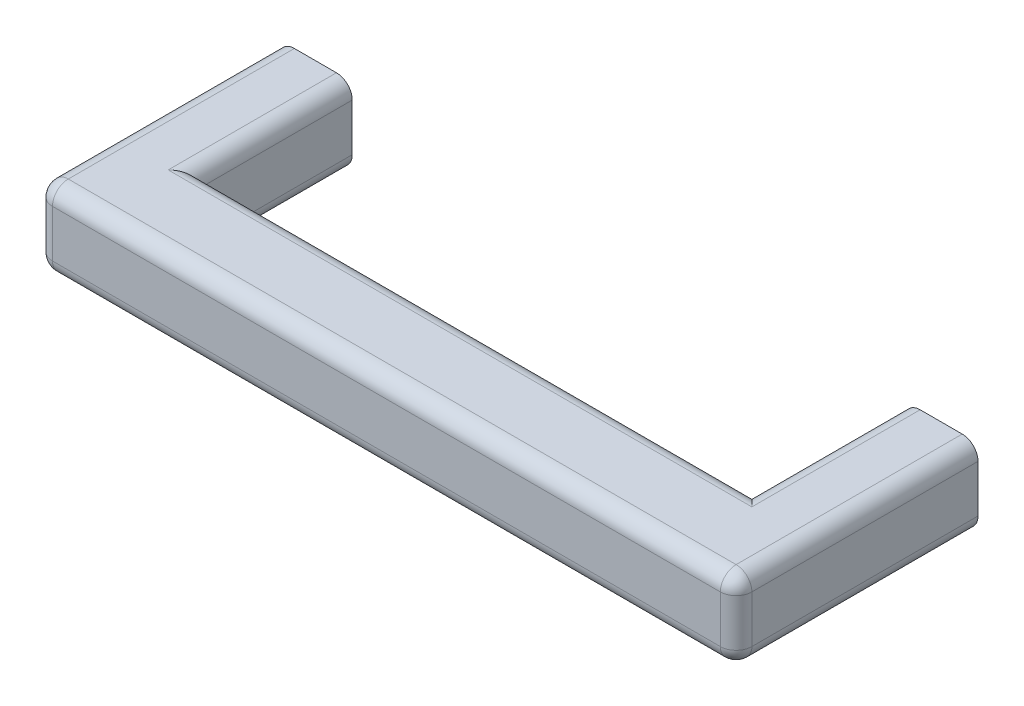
ISO-10303-21;
HEADER;
FILE_DESCRIPTION(('STEP AP214'),'2;1');
FILE_NAME('part.step','',(''),(''),'','','');
FILE_SCHEMA(('AUTOMOTIVE_DESIGN { 1 0 10303 214 1 1 1 1 }'));
ENDSEC;
DATA;
#1=APPLICATION_CONTEXT('core data for automotive mechanical design processes');
#2=APPLICATION_PROTOCOL_DEFINITION('international standard','automotive_design',2000,#1);
#3=PRODUCT_CONTEXT('',#1,'mechanical');
#4=PRODUCT('Part','Part','',(#3));
#5=PRODUCT_RELATED_PRODUCT_CATEGORY('part','',(#4));
#6=PRODUCT_DEFINITION_FORMATION('','',#4);
#7=PRODUCT_DEFINITION_CONTEXT('part definition',#1,'design');
#8=PRODUCT_DEFINITION('design','',#6,#7);
#9=PRODUCT_DEFINITION_SHAPE('','',#8);
#10=(LENGTH_UNIT() NAMED_UNIT(*) SI_UNIT(.MILLI.,.METRE.));
#11=(NAMED_UNIT(*) PLANE_ANGLE_UNIT() SI_UNIT($,.RADIAN.));
#12=(NAMED_UNIT(*) SI_UNIT($,.STERADIAN.) SOLID_ANGLE_UNIT());
#13=UNCERTAINTY_MEASURE_WITH_UNIT(LENGTH_MEASURE(1.E-05),#10,'distance_accuracy_value','');
#14=(GEOMETRIC_REPRESENTATION_CONTEXT(3) GLOBAL_UNCERTAINTY_ASSIGNED_CONTEXT((#13)) GLOBAL_UNIT_ASSIGNED_CONTEXT((#10,
#11,#12)) REPRESENTATION_CONTEXT('',''));
#15=CARTESIAN_POINT('',(0.,0.,0.));
#16=DIRECTION('',(0.,0.,1.));
#17=DIRECTION('',(1.,0.,0.));
#18=AXIS2_PLACEMENT_3D('',#15,#16,#17);
#19=CARTESIAN_POINT('',(-66.5,15.,0.));
#20=DIRECTION('',(1.,0.,0.));
#21=DIRECTION('',(0.,0.,-1.));
#22=AXIS2_PLACEMENT_3D('',#19,#20,#21);
#23=PLANE('',#22);
#24=DIRECTION('',(0.,-1.,0.));
#25=VECTOR('',#24,1.);
#26=CARTESIAN_POINT('',(-66.5,15.,-2.99999999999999));
#27=LINE('',#26,#25);
#28=CARTESIAN_POINT('',(-66.5,3.,-2.99999999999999));
#29=VERTEX_POINT('',#28);
#30=CARTESIAN_POINT('',(-66.5,12.,-2.99999999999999));
#31=VERTEX_POINT('',#30);
#32=EDGE_CURVE('E265',#29,#31,#27,.F.);
#33=ORIENTED_EDGE('',*,*,#32,.T.);
#34=DIRECTION('',(0.,0.,1.));
#35=VECTOR('',#34,1.);
#36=CARTESIAN_POINT('',(-66.5,12.,0.));
#37=LINE('',#36,#35);
#38=CARTESIAN_POINT('',(-66.5,12.,-46.));
#39=VERTEX_POINT('',#38);
#40=EDGE_CURVE('E267',#31,#39,#37,.F.);
#41=ORIENTED_EDGE('',*,*,#40,.T.);
#42=DIRECTION('',(0.,-1.,0.));
#43=VECTOR('',#42,1.);
#44=CARTESIAN_POINT('',(-66.5,15.,-46.));
#45=LINE('',#44,#43);
#46=CARTESIAN_POINT('',(-66.5,3.,-46.));
#47=VERTEX_POINT('',#46);
#48=EDGE_CURVE('E188',#39,#47,#45,.T.);
#49=ORIENTED_EDGE('',*,*,#48,.T.);
#50=DIRECTION('',(0.,0.,1.));
#51=VECTOR('',#50,1.);
#52=CARTESIAN_POINT('',(-66.5,3.,0.));
#53=LINE('',#52,#51);
#54=EDGE_CURVE('E263',#47,#29,#53,.T.);
#55=ORIENTED_EDGE('',*,*,#54,.T.);
#56=EDGE_LOOP('',(#33,#41,#49,#55));
#57=FACE_BOUND('',#56,.T.);
#58=ADVANCED_FACE('F33',(#57),#23,.F.);
#59=CARTESIAN_POINT('',(66.5,15.,0.));
#60=DIRECTION('',(0.,0.,-1.));
#61=DIRECTION('',(-1.,0.,0.));
#62=AXIS2_PLACEMENT_3D('',#59,#60,#61);
#63=PLANE('',#62);
#64=DIRECTION('',(1.,0.,0.));
#65=VECTOR('',#64,1.);
#66=CARTESIAN_POINT('',(66.5,3.,0.));
#67=LINE('',#66,#65);
#68=CARTESIAN_POINT('',(-63.5,3.,0.));
#69=VERTEX_POINT('',#68);
#70=CARTESIAN_POINT('',(63.5,3.,0.));
#71=VERTEX_POINT('',#70);
#72=EDGE_CURVE('E237',#69,#71,#67,.T.);
#73=ORIENTED_EDGE('',*,*,#72,.T.);
#74=DIRECTION('',(0.,-1.,0.));
#75=VECTOR('',#74,1.);
#76=CARTESIAN_POINT('',(63.5,15.,0.));
#77=LINE('',#76,#75);
#78=CARTESIAN_POINT('',(63.5,12.,0.));
#79=VERTEX_POINT('',#78);
#80=EDGE_CURVE('E243',#71,#79,#77,.F.);
#81=ORIENTED_EDGE('',*,*,#80,.T.);
#82=DIRECTION('',(1.,0.,0.));
#83=VECTOR('',#82,1.);
#84=CARTESIAN_POINT('',(66.5,12.,0.));
#85=LINE('',#84,#83);
#86=CARTESIAN_POINT('',(-63.5,12.,0.));
#87=VERTEX_POINT('',#86);
#88=EDGE_CURVE('E241',#79,#87,#85,.F.);
#89=ORIENTED_EDGE('',*,*,#88,.T.);
#90=DIRECTION('',(0.,-1.,0.));
#91=VECTOR('',#90,1.);
#92=CARTESIAN_POINT('',(-63.5,15.,0.));
#93=LINE('',#92,#91);
#94=EDGE_CURVE('E239',#87,#69,#93,.T.);
#95=ORIENTED_EDGE('',*,*,#94,.T.);
#96=EDGE_LOOP('',(#73,#81,#89,#95));
#97=FACE_BOUND('',#96,.T.);
#98=ADVANCED_FACE('F390',(#97),#63,.F.);
#99=CARTESIAN_POINT('',(66.5,15.,0.));
#100=DIRECTION('',(-1.,0.,0.));
#101=DIRECTION('',(0.,0.,1.));
#102=AXIS2_PLACEMENT_3D('',#99,#100,#101);
#103=PLANE('',#102);
#104=DIRECTION('',(0.,-1.,0.));
#105=VECTOR('',#104,1.);
#106=CARTESIAN_POINT('',(66.5,15.,-46.));
#107=LINE('',#106,#105);
#108=CARTESIAN_POINT('',(66.5,12.,-46.));
#109=VERTEX_POINT('',#108);
#110=CARTESIAN_POINT('',(66.5,3.,-46.));
#111=VERTEX_POINT('',#110);
#112=EDGE_CURVE('E214',#109,#111,#107,.T.);
#113=ORIENTED_EDGE('',*,*,#112,.F.);
#114=DIRECTION('',(0.,0.,-1.));
#115=VECTOR('',#114,1.);
#116=CARTESIAN_POINT('',(66.5,12.,0.));
#117=LINE('',#116,#115);
#118=CARTESIAN_POINT('',(66.5,12.,-3.00000000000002));
#119=VERTEX_POINT('',#118);
#120=EDGE_CURVE('E162',#109,#119,#117,.F.);
#121=ORIENTED_EDGE('',*,*,#120,.T.);
#122=DIRECTION('',(0.,-1.,0.));
#123=VECTOR('',#122,1.);
#124=CARTESIAN_POINT('',(66.5,15.,-3.00000000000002));
#125=LINE('',#124,#123);
#126=CARTESIAN_POINT('',(66.5,3.,-3.00000000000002));
#127=VERTEX_POINT('',#126);
#128=EDGE_CURVE('E234',#119,#127,#125,.T.);
#129=ORIENTED_EDGE('',*,*,#128,.T.);
#130=DIRECTION('',(0.,0.,-1.));
#131=VECTOR('',#130,1.);
#132=CARTESIAN_POINT('',(66.5,3.,-46.));
#133=LINE('',#132,#131);
#134=EDGE_CURVE('E232',#127,#111,#133,.T.);
#135=ORIENTED_EDGE('',*,*,#134,.T.);
#136=EDGE_LOOP('',(#113,#121,#129,#135));
#137=FACE_BOUND('',#136,.T.);
#138=ADVANCED_FACE('F416',(#137),#103,.F.);
#139=CARTESIAN_POINT('',(66.5,15.,-46.));
#140=DIRECTION('',(0.,0.,1.));
#141=DIRECTION('',(1.,0.,0.));
#142=AXIS2_PLACEMENT_3D('',#139,#140,#141);
#143=PLANE('',#142);
#144=CARTESIAN_POINT('',(59.5,7.5,-45.9999999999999));
#145=DIRECTION('',(0.,0.,-1.));
#146=DIRECTION('',(-1.,0.,0.));
#147=AXIS2_PLACEMENT_3D('',#144,#145,#146);
#148=CIRCLE('',#147,2.01022380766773);
#149=CARTESIAN_POINT('',(57.4897761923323,7.5,-45.9999999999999));
#150=VERTEX_POINT('',#149);
#151=EDGE_CURVE('E194',#150,#150,#148,.T.);
#152=ORIENTED_EDGE('',*,*,#151,.F.);
#153=EDGE_LOOP('',(#152));
#154=FACE_BOUND('',#153,.T.);
#155=DIRECTION('',(0.,-1.,0.));
#156=VECTOR('',#155,1.);
#157=CARTESIAN_POINT('',(52.5,15.,-46.));
#158=LINE('',#157,#156);
#159=CARTESIAN_POINT('',(52.5,12.,-46.));
#160=VERTEX_POINT('',#159);
#161=CARTESIAN_POINT('',(52.5,3.,-46.));
#162=VERTEX_POINT('',#161);
#163=EDGE_CURVE('E211',#160,#162,#158,.T.);
#164=ORIENTED_EDGE('',*,*,#163,.F.);
#165=CARTESIAN_POINT('',(55.5,12.,-46.));
#166=DIRECTION('',(0.,0.,1.));
#167=DIRECTION('',(1.,0.,0.));
#168=AXIS2_PLACEMENT_3D('',#165,#166,#167);
#169=CIRCLE('',#168,3.);
#170=CARTESIAN_POINT('',(55.5,15.,-46.));
#171=VERTEX_POINT('',#170);
#172=EDGE_CURVE('E167',#160,#171,#169,.F.);
#173=ORIENTED_EDGE('',*,*,#172,.T.);
#174=DIRECTION('',(-1.,0.,0.));
#175=VECTOR('',#174,1.);
#176=CARTESIAN_POINT('',(66.5,15.,-46.));
#177=LINE('',#176,#175);
#178=CARTESIAN_POINT('',(63.5,15.,-46.));
#179=VERTEX_POINT('',#178);
#180=EDGE_CURVE('E174',#179,#171,#177,.T.);
#181=ORIENTED_EDGE('',*,*,#180,.F.);
#182=CARTESIAN_POINT('',(63.5,12.,-46.));
#183=DIRECTION('',(0.,0.,1.));
#184=DIRECTION('',(1.,0.,0.));
#185=AXIS2_PLACEMENT_3D('',#182,#183,#184);
#186=CIRCLE('',#185,3.);
#187=EDGE_CURVE('E157',#179,#109,#186,.F.);
#188=ORIENTED_EDGE('',*,*,#187,.T.);
#189=ORIENTED_EDGE('',*,*,#112,.T.);
#190=CARTESIAN_POINT('',(63.5,3.,-46.));
#191=DIRECTION('',(0.,0.,1.));
#192=DIRECTION('',(1.,0.,0.));
#193=AXIS2_PLACEMENT_3D('',#190,#191,#192);
#194=CIRCLE('',#193,3.);
#195=CARTESIAN_POINT('',(63.5,0.,-46.));
#196=VERTEX_POINT('',#195);
#197=EDGE_CURVE('E168',#111,#196,#194,.F.);
#198=ORIENTED_EDGE('',*,*,#197,.T.);
#199=DIRECTION('',(-1.,0.,0.));
#200=VECTOR('',#199,1.);
#201=CARTESIAN_POINT('',(66.5,0.,-46.));
#202=LINE('',#201,#200);
#203=CARTESIAN_POINT('',(55.5,0.,-46.));
#204=VERTEX_POINT('',#203);
#205=EDGE_CURVE('E191',#196,#204,#202,.T.);
#206=ORIENTED_EDGE('',*,*,#205,.T.);
#207=CARTESIAN_POINT('',(55.5,3.,-46.));
#208=DIRECTION('',(0.,0.,1.));
#209=DIRECTION('',(1.,0.,0.));
#210=AXIS2_PLACEMENT_3D('',#207,#208,#209);
#211=CIRCLE('',#210,3.);
#212=EDGE_CURVE('E228',#204,#162,#211,.F.);
#213=ORIENTED_EDGE('',*,*,#212,.T.);
#214=EDGE_LOOP('',(#164,#173,#181,#188,#189,#198,#206,#213));
#215=FACE_BOUND('',#214,.T.);
#216=ADVANCED_FACE('F182',(#154,#215),#143,.F.);
#217=CARTESIAN_POINT('',(52.5,15.,-46.));
#218=DIRECTION('',(1.,0.,0.));
#219=DIRECTION('',(0.,0.,-1.));
#220=AXIS2_PLACEMENT_3D('',#217,#218,#219);
#221=PLANE('',#220);
#222=DIRECTION('',(0.,-1.,0.));
#223=VECTOR('',#222,1.);
#224=CARTESIAN_POINT('',(52.5,15.,-17.));
#225=LINE('',#224,#223);
#226=CARTESIAN_POINT('',(52.5,12.,-17.));
#227=VERTEX_POINT('',#226);
#228=CARTESIAN_POINT('',(52.5,3.,-17.));
#229=VERTEX_POINT('',#228);
#230=EDGE_CURVE('E208',#227,#229,#225,.T.);
#231=ORIENTED_EDGE('',*,*,#230,.F.);
#232=DIRECTION('',(0.,0.,1.));
#233=VECTOR('',#232,1.);
#234=CARTESIAN_POINT('',(52.5,12.,-46.));
#235=LINE('',#234,#233);
#236=EDGE_CURVE('E226',#227,#160,#235,.F.);
#237=ORIENTED_EDGE('',*,*,#236,.T.);
#238=ORIENTED_EDGE('',*,*,#163,.T.);
#239=DIRECTION('',(0.,0.,1.));
#240=VECTOR('',#239,1.);
#241=CARTESIAN_POINT('',(52.5,3.,-17.));
#242=LINE('',#241,#240);
#243=EDGE_CURVE('E224',#162,#229,#242,.T.);
#244=ORIENTED_EDGE('',*,*,#243,.T.);
#245=EDGE_LOOP('',(#231,#237,#238,#244));
#246=FACE_BOUND('',#245,.T.);
#247=ADVANCED_FACE('F632',(#246),#221,.F.);
#248=CARTESIAN_POINT('',(-52.5,15.,-17.));
#249=DIRECTION('',(0.,0.,1.));
#250=DIRECTION('',(1.,0.,0.));
#251=AXIS2_PLACEMENT_3D('',#248,#249,#250);
#252=PLANE('',#251);
#253=DIRECTION('',(0.,-1.,0.));
#254=VECTOR('',#253,1.);
#255=CARTESIAN_POINT('',(-52.5,15.,-17.));
#256=LINE('',#255,#254);
#257=CARTESIAN_POINT('',(-52.5,12.,-17.));
#258=VERTEX_POINT('',#257);
#259=CARTESIAN_POINT('',(-52.5,3.,-17.));
#260=VERTEX_POINT('',#259);
#261=EDGE_CURVE('E205',#258,#260,#256,.T.);
#262=ORIENTED_EDGE('',*,*,#261,.F.);
#263=DIRECTION('',(-1.,0.,0.));
#264=VECTOR('',#263,1.);
#265=CARTESIAN_POINT('',(-52.5,12.,-17.));
#266=LINE('',#265,#264);
#267=EDGE_CURVE('E248',#258,#227,#266,.F.);
#268=ORIENTED_EDGE('',*,*,#267,.T.);
#269=ORIENTED_EDGE('',*,*,#230,.T.);
#270=DIRECTION('',(-1.,0.,0.));
#271=VECTOR('',#270,1.);
#272=CARTESIAN_POINT('',(-52.5,3.,-17.));
#273=LINE('',#272,#271);
#274=EDGE_CURVE('E246',#229,#260,#273,.T.);
#275=ORIENTED_EDGE('',*,*,#274,.T.);
#276=EDGE_LOOP('',(#262,#268,#269,#275));
#277=FACE_BOUND('',#276,.T.);
#278=ADVANCED_FACE('F363',(#277),#252,.F.);
#279=CARTESIAN_POINT('',(-52.5,15.,-46.));
#280=DIRECTION('',(-1.,0.,0.));
#281=DIRECTION('',(0.,0.,1.));
#282=AXIS2_PLACEMENT_3D('',#279,#280,#281);
#283=PLANE('',#282);
#284=DIRECTION('',(0.,-1.,0.));
#285=VECTOR('',#284,1.);
#286=CARTESIAN_POINT('',(-52.5,15.,-46.));
#287=LINE('',#286,#285);
#288=CARTESIAN_POINT('',(-52.5,12.,-46.));
#289=VERTEX_POINT('',#288);
#290=CARTESIAN_POINT('',(-52.5,3.,-46.));
#291=VERTEX_POINT('',#290);
#292=EDGE_CURVE('E202',#289,#291,#287,.T.);
#293=ORIENTED_EDGE('',*,*,#292,.F.);
#294=DIRECTION('',(0.,0.,-1.));
#295=VECTOR('',#294,1.);
#296=CARTESIAN_POINT('',(-52.5,12.,-46.));
#297=LINE('',#296,#295);
#298=EDGE_CURVE('E261',#289,#258,#297,.F.);
#299=ORIENTED_EDGE('',*,*,#298,.T.);
#300=ORIENTED_EDGE('',*,*,#261,.T.);
#301=DIRECTION('',(0.,0.,-1.));
#302=VECTOR('',#301,1.);
#303=CARTESIAN_POINT('',(-52.5,3.,-46.));
#304=LINE('',#303,#302);
#305=EDGE_CURVE('E258',#260,#291,#304,.T.);
#306=ORIENTED_EDGE('',*,*,#305,.T.);
#307=EDGE_LOOP('',(#293,#299,#300,#306));
#308=FACE_BOUND('',#307,.T.);
#309=ADVANCED_FACE('F346',(#308),#283,.F.);
#310=CARTESIAN_POINT('',(-66.5,15.,-46.));
#311=DIRECTION('',(0.,0.,1.));
#312=DIRECTION('',(1.,0.,0.));
#313=AXIS2_PLACEMENT_3D('',#310,#311,#312);
#314=PLANE('',#313);
#315=CARTESIAN_POINT('',(-59.5,7.5,-46.));
#316=DIRECTION('',(0.,0.,-1.));
#317=DIRECTION('',(1.,0.,0.));
#318=AXIS2_PLACEMENT_3D('',#315,#316,#317);
#319=CIRCLE('',#318,2.01022380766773);
#320=CARTESIAN_POINT('',(-57.4897761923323,7.5,-46.));
#321=VERTEX_POINT('',#320);
#322=EDGE_CURVE('E328',#321,#321,#319,.T.);
#323=ORIENTED_EDGE('',*,*,#322,.F.);
#324=EDGE_LOOP('',(#323));
#325=FACE_BOUND('',#324,.T.);
#326=DIRECTION('',(-1.,0.,0.));
#327=VECTOR('',#326,1.);
#328=CARTESIAN_POINT('',(-66.5,15.,-46.));
#329=LINE('',#328,#327);
#330=CARTESIAN_POINT('',(-55.5,15.,-46.));
#331=VERTEX_POINT('',#330);
#332=CARTESIAN_POINT('',(-63.5,15.,-46.));
#333=VERTEX_POINT('',#332);
#334=EDGE_CURVE('E184',#331,#333,#329,.T.);
#335=ORIENTED_EDGE('',*,*,#334,.F.);
#336=CARTESIAN_POINT('',(-55.5,12.,-46.));
#337=DIRECTION('',(0.,0.,1.));
#338=DIRECTION('',(1.,0.,0.));
#339=AXIS2_PLACEMENT_3D('',#336,#337,#338);
#340=CIRCLE('',#339,3.);
#341=EDGE_CURVE('E256',#331,#289,#340,.F.);
#342=ORIENTED_EDGE('',*,*,#341,.T.);
#343=ORIENTED_EDGE('',*,*,#292,.T.);
#344=CARTESIAN_POINT('',(-55.5,3.,-46.));
#345=DIRECTION('',(0.,0.,1.));
#346=DIRECTION('',(1.,0.,0.));
#347=AXIS2_PLACEMENT_3D('',#344,#345,#346);
#348=CIRCLE('',#347,3.);
#349=CARTESIAN_POINT('',(-55.5,0.,-46.));
#350=VERTEX_POINT('',#349);
#351=EDGE_CURVE('E250',#291,#350,#348,.F.);
#352=ORIENTED_EDGE('',*,*,#351,.T.);
#353=DIRECTION('',(-1.,0.,0.));
#354=VECTOR('',#353,1.);
#355=CARTESIAN_POINT('',(-66.5,0.,-46.));
#356=LINE('',#355,#354);
#357=CARTESIAN_POINT('',(-63.5,0.,-46.));
#358=VERTEX_POINT('',#357);
#359=EDGE_CURVE('E185',#350,#358,#356,.T.);
#360=ORIENTED_EDGE('',*,*,#359,.T.);
#361=CARTESIAN_POINT('',(-63.5,3.,-46.));
#362=DIRECTION('',(0.,0.,1.));
#363=DIRECTION('',(1.,0.,0.));
#364=AXIS2_PLACEMENT_3D('',#361,#362,#363);
#365=CIRCLE('',#364,3.);
#366=EDGE_CURVE('E252',#358,#47,#365,.F.);
#367=ORIENTED_EDGE('',*,*,#366,.T.);
#368=ORIENTED_EDGE('',*,*,#48,.F.);
#369=CARTESIAN_POINT('',(-63.5,12.,-46.));
#370=DIRECTION('',(0.,0.,1.));
#371=DIRECTION('',(1.,0.,0.));
#372=AXIS2_PLACEMENT_3D('',#369,#370,#371);
#373=CIRCLE('',#372,3.);
#374=EDGE_CURVE('E254',#39,#333,#373,.F.);
#375=ORIENTED_EDGE('',*,*,#374,.T.);
#376=EDGE_LOOP('',(#335,#342,#343,#352,#360,#367,#368,#375));
#377=FACE_BOUND('',#376,.T.);
#378=ADVANCED_FACE('F343',(#325,#377),#314,.F.);
#379=CARTESIAN_POINT('',(0.,15.,0.));
#380=DIRECTION('',(0.,-1.,0.));
#381=DIRECTION('',(0.,0.,-1.));
#382=AXIS2_PLACEMENT_3D('',#379,#380,#381);
#383=PLANE('',#382);
#384=ORIENTED_EDGE('',*,*,#180,.T.);
#385=DIRECTION('',(0.,0.,1.));
#386=VECTOR('',#385,1.);
#387=CARTESIAN_POINT('',(55.5,15.,0.));
#388=LINE('',#387,#386);
#389=CARTESIAN_POINT('',(55.5,15.,-14.));
#390=VERTEX_POINT('',#389);
#391=EDGE_CURVE('E222',#171,#390,#388,.T.);
#392=ORIENTED_EDGE('',*,*,#391,.T.);
#393=DIRECTION('',(-1.,0.,0.));
#394=VECTOR('',#393,1.);
#395=CARTESIAN_POINT('',(0.,15.,-14.));
#396=LINE('',#395,#394);
#397=CARTESIAN_POINT('',(-55.5,15.,-14.));
#398=VERTEX_POINT('',#397);
#399=EDGE_CURVE('E220',#390,#398,#396,.T.);
#400=ORIENTED_EDGE('',*,*,#399,.T.);
#401=DIRECTION('',(0.,0.,-1.));
#402=VECTOR('',#401,1.);
#403=CARTESIAN_POINT('',(-55.5,15.,0.));
#404=LINE('',#403,#402);
#405=EDGE_CURVE('E179',#398,#331,#404,.T.);
#406=ORIENTED_EDGE('',*,*,#405,.T.);
#407=ORIENTED_EDGE('',*,*,#334,.T.);
#408=DIRECTION('',(0.,0.,1.));
#409=VECTOR('',#408,1.);
#410=CARTESIAN_POINT('',(-63.5,15.,0.));
#411=LINE('',#410,#409);
#412=CARTESIAN_POINT('',(-63.5,15.,-2.99999999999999));
#413=VERTEX_POINT('',#412);
#414=EDGE_CURVE('E216',#333,#413,#411,.T.);
#415=ORIENTED_EDGE('',*,*,#414,.T.);
#416=DIRECTION('',(1.,0.,0.));
#417=VECTOR('',#416,1.);
#418=CARTESIAN_POINT('',(0.,15.,-3.));
#419=LINE('',#418,#417);
#420=CARTESIAN_POINT('',(63.5,15.,-3.00000000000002));
#421=VERTEX_POINT('',#420);
#422=EDGE_CURVE('E177',#413,#421,#419,.T.);
#423=ORIENTED_EDGE('',*,*,#422,.T.);
#424=DIRECTION('',(0.,0.,-1.));
#425=VECTOR('',#424,1.);
#426=CARTESIAN_POINT('',(63.5,15.,0.));
#427=LINE('',#426,#425);
#428=EDGE_CURVE('E161',#421,#179,#427,.T.);
#429=ORIENTED_EDGE('',*,*,#428,.T.);
#430=EDGE_LOOP('',(#384,#392,#400,#406,#407,#415,#423,#429));
#431=FACE_BOUND('',#430,.T.);
#432=ADVANCED_FACE('F172',(#431),#383,.F.);
#433=CARTESIAN_POINT('',(0.,0.,0.));
#434=DIRECTION('',(0.,-1.,0.));
#435=DIRECTION('',(0.,0.,-1.));
#436=AXIS2_PLACEMENT_3D('',#433,#434,#435);
#437=PLANE('',#436);
#438=DIRECTION('',(1.,0.,0.));
#439=VECTOR('',#438,1.);
#440=CARTESIAN_POINT('',(-66.5,0.,-2.99999999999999));
#441=LINE('',#440,#439);
#442=CARTESIAN_POINT('',(63.5,0.,-3.00000000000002));
#443=VERTEX_POINT('',#442);
#444=CARTESIAN_POINT('',(-63.5,0.,-2.99999999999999));
#445=VERTEX_POINT('',#444);
#446=EDGE_CURVE('E42',#443,#445,#441,.F.);
#447=ORIENTED_EDGE('',*,*,#446,.T.);
#448=DIRECTION('',(0.,0.,1.));
#449=VECTOR('',#448,1.);
#450=CARTESIAN_POINT('',(-63.5,0.,-46.));
#451=LINE('',#450,#449);
#452=EDGE_CURVE('E11',#445,#358,#451,.F.);
#453=ORIENTED_EDGE('',*,*,#452,.T.);
#454=ORIENTED_EDGE('',*,*,#359,.F.);
#455=DIRECTION('',(0.,0.,-1.));
#456=VECTOR('',#455,1.);
#457=CARTESIAN_POINT('',(-55.5,0.,-17.));
#458=LINE('',#457,#456);
#459=CARTESIAN_POINT('',(-55.5,0.,-14.));
#460=VERTEX_POINT('',#459);
#461=EDGE_CURVE('E273',#350,#460,#458,.F.);
#462=ORIENTED_EDGE('',*,*,#461,.T.);
#463=DIRECTION('',(-1.,0.,0.));
#464=VECTOR('',#463,1.);
#465=CARTESIAN_POINT('',(52.5,0.,-14.));
#466=LINE('',#465,#464);
#467=CARTESIAN_POINT('',(55.5,0.,-14.));
#468=VERTEX_POINT('',#467);
#469=EDGE_CURVE('E271',#460,#468,#466,.F.);
#470=ORIENTED_EDGE('',*,*,#469,.T.);
#471=DIRECTION('',(0.,0.,1.));
#472=VECTOR('',#471,1.);
#473=CARTESIAN_POINT('',(55.5,0.,-46.));
#474=LINE('',#473,#472);
#475=EDGE_CURVE('E269',#468,#204,#474,.F.);
#476=ORIENTED_EDGE('',*,*,#475,.T.);
#477=ORIENTED_EDGE('',*,*,#205,.F.);
#478=DIRECTION('',(0.,0.,-1.));
#479=VECTOR('',#478,1.);
#480=CARTESIAN_POINT('',(63.5,0.,0.));
#481=LINE('',#480,#479);
#482=EDGE_CURVE('E53',#196,#443,#481,.F.);
#483=ORIENTED_EDGE('',*,*,#482,.T.);
#484=EDGE_LOOP('',(#447,#453,#454,#462,#470,#476,#477,#483));
#485=FACE_BOUND('',#484,.T.);
#486=ADVANCED_FACE('F373',(#485),#437,.T.);
#487=CARTESIAN_POINT('',(-55.5,12.,0.));
#488=DIRECTION('',(0.,0.,-1.));
#489=DIRECTION('',(-1.,0.,0.));
#490=AXIS2_PLACEMENT_3D('',#487,#488,#489);
#491=CYLINDRICAL_SURFACE('',#490,3.);
#492=ORIENTED_EDGE('',*,*,#341,.F.);
#493=ORIENTED_EDGE('',*,*,#405,.F.);
#494=CARTESIAN_POINT('',(-55.5,12.,-14.));
#495=DIRECTION('',(-0.707106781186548,0.,-0.707106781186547));
#496=DIRECTION('',(-0.707106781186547,0.,0.707106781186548));
#497=AXIS2_PLACEMENT_3D('',#494,#495,#496);
#498=ELLIPSE('',#497,4.24264068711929,3.);
#499=EDGE_CURVE('E198',#258,#398,#498,.F.);
#500=ORIENTED_EDGE('',*,*,#499,.F.);
#501=ORIENTED_EDGE('',*,*,#298,.F.);
#502=EDGE_LOOP('',(#492,#493,#500,#501));
#503=FACE_BOUND('',#502,.T.);
#504=ADVANCED_FACE('F357',(#503),#491,.T.);
#505=CARTESIAN_POINT('',(0.,12.,-14.));
#506=DIRECTION('',(-1.,0.,0.));
#507=DIRECTION('',(0.,0.,1.));
#508=AXIS2_PLACEMENT_3D('',#505,#506,#507);
#509=CYLINDRICAL_SURFACE('',#508,3.);
#510=ORIENTED_EDGE('',*,*,#499,.T.);
#511=ORIENTED_EDGE('',*,*,#399,.F.);
#512=CARTESIAN_POINT('',(55.5,12.,-14.));
#513=DIRECTION('',(-0.707106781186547,0.,0.707106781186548));
#514=DIRECTION('',(0.707106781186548,0.,0.707106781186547));
#515=AXIS2_PLACEMENT_3D('',#512,#513,#514);
#516=ELLIPSE('',#515,4.24264068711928,3.);
#517=EDGE_CURVE('E277',#227,#390,#516,.F.);
#518=ORIENTED_EDGE('',*,*,#517,.F.);
#519=ORIENTED_EDGE('',*,*,#267,.F.);
#520=EDGE_LOOP('',(#510,#511,#518,#519));
#521=FACE_BOUND('',#520,.T.);
#522=ADVANCED_FACE('F441',(#521),#509,.T.);
#523=CARTESIAN_POINT('',(55.5,12.,0.));
#524=DIRECTION('',(0.,0.,1.));
#525=DIRECTION('',(1.,0.,0.));
#526=AXIS2_PLACEMENT_3D('',#523,#524,#525);
#527=CYLINDRICAL_SURFACE('',#526,3.);
#528=ORIENTED_EDGE('',*,*,#172,.F.);
#529=ORIENTED_EDGE('',*,*,#236,.F.);
#530=ORIENTED_EDGE('',*,*,#517,.T.);
#531=ORIENTED_EDGE('',*,*,#391,.F.);
#532=EDGE_LOOP('',(#528,#529,#530,#531));
#533=FACE_BOUND('',#532,.T.);
#534=ADVANCED_FACE('F438',(#533),#527,.T.);
#535=CARTESIAN_POINT('',(-63.5,3.,0.));
#536=DIRECTION('',(0.,0.,-1.));
#537=DIRECTION('',(-1.,0.,0.));
#538=AXIS2_PLACEMENT_3D('',#535,#536,#537);
#539=CYLINDRICAL_SURFACE('',#538,3.);
#540=CARTESIAN_POINT('',(-63.5,3.,-2.99999999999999));
#541=DIRECTION('',(0.,0.,1.));
#542=DIRECTION('',(1.,0.,0.));
#543=AXIS2_PLACEMENT_3D('',#540,#541,#542);
#544=CIRCLE('',#543,3.);
#545=EDGE_CURVE('E279',#29,#445,#544,.T.);
#546=ORIENTED_EDGE('',*,*,#545,.F.);
#547=ORIENTED_EDGE('',*,*,#54,.F.);
#548=ORIENTED_EDGE('',*,*,#366,.F.);
#549=ORIENTED_EDGE('',*,*,#452,.F.);
#550=EDGE_LOOP('',(#546,#547,#548,#549));
#551=FACE_BOUND('',#550,.T.);
#552=ADVANCED_FACE('F376',(#551),#539,.T.);
#553=CARTESIAN_POINT('',(-63.5,3.,-2.99999999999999));
#554=DIRECTION('',(0.,0.,1.));
#555=DIRECTION('',(1.,0.,0.));
#556=AXIS2_PLACEMENT_3D('',#553,#554,#555);
#557=SPHERICAL_SURFACE('',#556,3.);
#558=CARTESIAN_POINT('',(-63.5,3.,-2.99999999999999));
#559=DIRECTION('',(0.,-1.,0.));
#560=DIRECTION('',(0.,0.,-1.));
#561=AXIS2_PLACEMENT_3D('',#558,#559,#560);
#562=CIRCLE('',#561,3.);
#563=EDGE_CURVE('E307',#29,#69,#562,.F.);
#564=ORIENTED_EDGE('',*,*,#563,.F.);
#565=ORIENTED_EDGE('',*,*,#545,.T.);
#566=CARTESIAN_POINT('',(-63.5,3.,-2.99999999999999));
#567=DIRECTION('',(-1.,0.,0.));
#568=DIRECTION('',(0.,0.,1.));
#569=AXIS2_PLACEMENT_3D('',#566,#567,#568);
#570=CIRCLE('',#569,3.);
#571=EDGE_CURVE('E310',#69,#445,#570,.F.);
#572=ORIENTED_EDGE('',*,*,#571,.F.);
#573=EDGE_LOOP('',(#564,#565,#572));
#574=FACE_BOUND('',#573,.T.);
#575=ADVANCED_FACE('F381',(#574),#557,.T.);
#576=CARTESIAN_POINT('',(63.5,3.,0.));
#577=DIRECTION('',(0.,0.,1.));
#578=DIRECTION('',(1.,0.,0.));
#579=AXIS2_PLACEMENT_3D('',#576,#577,#578);
#580=CYLINDRICAL_SURFACE('',#579,3.);
#581=ORIENTED_EDGE('',*,*,#197,.F.);
#582=ORIENTED_EDGE('',*,*,#134,.F.);
#583=CARTESIAN_POINT('',(63.5,3.,-3.00000000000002));
#584=DIRECTION('',(0.,0.,1.));
#585=DIRECTION('',(1.,0.,0.));
#586=AXIS2_PLACEMENT_3D('',#583,#584,#585);
#587=CIRCLE('',#586,3.);
#588=EDGE_CURVE('E304',#443,#127,#587,.T.);
#589=ORIENTED_EDGE('',*,*,#588,.F.);
#590=ORIENTED_EDGE('',*,*,#482,.F.);
#591=EDGE_LOOP('',(#581,#582,#589,#590));
#592=FACE_BOUND('',#591,.T.);
#593=ADVANCED_FACE('F419',(#592),#580,.T.);
#594=CARTESIAN_POINT('',(66.5,3.,-3.00000000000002));
#595=DIRECTION('',(-1.,0.,0.));
#596=DIRECTION('',(0.,0.,1.));
#597=AXIS2_PLACEMENT_3D('',#594,#595,#596);
#598=CYLINDRICAL_SURFACE('',#597,3.);
#599=ORIENTED_EDGE('',*,*,#571,.T.);
#600=ORIENTED_EDGE('',*,*,#446,.F.);
#601=CARTESIAN_POINT('',(63.5,3.,-3.00000000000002));
#602=DIRECTION('',(1.,0.,0.));
#603=DIRECTION('',(0.,0.,-1.));
#604=AXIS2_PLACEMENT_3D('',#601,#602,#603);
#605=CIRCLE('',#604,3.);
#606=EDGE_CURVE('E301',#71,#443,#605,.T.);
#607=ORIENTED_EDGE('',*,*,#606,.F.);
#608=ORIENTED_EDGE('',*,*,#72,.F.);
#609=EDGE_LOOP('',(#599,#600,#607,#608));
#610=FACE_BOUND('',#609,.T.);
#611=ADVANCED_FACE('F385',(#610),#598,.T.);
#612=CARTESIAN_POINT('',(-63.5,15.,-2.99999999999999));
#613=DIRECTION('',(0.,-1.,0.));
#614=DIRECTION('',(0.,0.,-1.));
#615=AXIS2_PLACEMENT_3D('',#612,#613,#614);
#616=CYLINDRICAL_SURFACE('',#615,3.);
#617=ORIENTED_EDGE('',*,*,#563,.T.);
#618=ORIENTED_EDGE('',*,*,#94,.F.);
#619=CARTESIAN_POINT('',(-63.5,12.,-2.99999999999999));
#620=DIRECTION('',(0.,1.,0.));
#621=DIRECTION('',(0.,0.,1.));
#622=AXIS2_PLACEMENT_3D('',#619,#620,#621);
#623=CIRCLE('',#622,3.);
#624=EDGE_CURVE('E298',#31,#87,#623,.T.);
#625=ORIENTED_EDGE('',*,*,#624,.F.);
#626=ORIENTED_EDGE('',*,*,#32,.F.);
#627=EDGE_LOOP('',(#617,#618,#625,#626));
#628=FACE_BOUND('',#627,.T.);
#629=ADVANCED_FACE('F396',(#628),#616,.T.);
#630=CARTESIAN_POINT('',(-63.5,12.,0.));
#631=DIRECTION('',(0.,0.,1.));
#632=DIRECTION('',(1.,0.,0.));
#633=AXIS2_PLACEMENT_3D('',#630,#631,#632);
#634=CYLINDRICAL_SURFACE('',#633,3.);
#635=ORIENTED_EDGE('',*,*,#374,.F.);
#636=ORIENTED_EDGE('',*,*,#40,.F.);
#637=CARTESIAN_POINT('',(-63.5,12.,-2.99999999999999));
#638=DIRECTION('',(0.,0.,1.));
#639=DIRECTION('',(1.,0.,0.));
#640=AXIS2_PLACEMENT_3D('',#637,#638,#639);
#641=CIRCLE('',#640,3.);
#642=EDGE_CURVE('E295',#413,#31,#641,.T.);
#643=ORIENTED_EDGE('',*,*,#642,.F.);
#644=ORIENTED_EDGE('',*,*,#414,.F.);
#645=EDGE_LOOP('',(#635,#636,#643,#644));
#646=FACE_BOUND('',#645,.T.);
#647=ADVANCED_FACE('F401',(#646),#634,.T.);
#648=CARTESIAN_POINT('',(63.5,3.,-3.00000000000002));
#649=DIRECTION('',(0.,0.,1.));
#650=DIRECTION('',(1.,0.,0.));
#651=AXIS2_PLACEMENT_3D('',#648,#649,#650);
#652=SPHERICAL_SURFACE('',#651,3.);
#653=ORIENTED_EDGE('',*,*,#606,.T.);
#654=ORIENTED_EDGE('',*,*,#588,.T.);
#655=CARTESIAN_POINT('',(63.5,3.,-3.00000000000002));
#656=DIRECTION('',(0.,-1.,0.));
#657=DIRECTION('',(0.,0.,-1.));
#658=AXIS2_PLACEMENT_3D('',#655,#656,#657);
#659=CIRCLE('',#658,3.);
#660=EDGE_CURVE('E292',#71,#127,#659,.F.);
#661=ORIENTED_EDGE('',*,*,#660,.F.);
#662=EDGE_LOOP('',(#653,#654,#661));
#663=FACE_BOUND('',#662,.T.);
#664=ADVANCED_FACE('F421',(#663),#652,.T.);
#665=CARTESIAN_POINT('',(-63.5,12.,-2.99999999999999));
#666=DIRECTION('',(0.,0.,1.));
#667=DIRECTION('',(1.,0.,0.));
#668=AXIS2_PLACEMENT_3D('',#665,#666,#667);
#669=SPHERICAL_SURFACE('',#668,3.);
#670=ORIENTED_EDGE('',*,*,#642,.T.);
#671=ORIENTED_EDGE('',*,*,#624,.T.);
#672=CARTESIAN_POINT('',(-63.5,12.,-2.99999999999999));
#673=DIRECTION('',(-1.,0.,0.));
#674=DIRECTION('',(0.,0.,1.));
#675=AXIS2_PLACEMENT_3D('',#672,#673,#674);
#676=CIRCLE('',#675,3.);
#677=EDGE_CURVE('E289',#413,#87,#676,.F.);
#678=ORIENTED_EDGE('',*,*,#677,.F.);
#679=EDGE_LOOP('',(#670,#671,#678));
#680=FACE_BOUND('',#679,.T.);
#681=ADVANCED_FACE('F404',(#680),#669,.T.);
#682=CARTESIAN_POINT('',(63.5,15.,-3.00000000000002));
#683=DIRECTION('',(0.,-1.,0.));
#684=DIRECTION('',(0.,0.,-1.));
#685=AXIS2_PLACEMENT_3D('',#682,#683,#684);
#686=CYLINDRICAL_SURFACE('',#685,3.);
#687=ORIENTED_EDGE('',*,*,#660,.T.);
#688=ORIENTED_EDGE('',*,*,#128,.F.);
#689=CARTESIAN_POINT('',(63.5,12.,-3.00000000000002));
#690=DIRECTION('',(0.,1.,0.));
#691=DIRECTION('',(0.,0.,1.));
#692=AXIS2_PLACEMENT_3D('',#689,#690,#691);
#693=CIRCLE('',#692,3.);
#694=EDGE_CURVE('E286',#79,#119,#693,.T.);
#695=ORIENTED_EDGE('',*,*,#694,.F.);
#696=ORIENTED_EDGE('',*,*,#80,.F.);
#697=EDGE_LOOP('',(#687,#688,#695,#696));
#698=FACE_BOUND('',#697,.T.);
#699=ADVANCED_FACE('F413',(#698),#686,.T.);
#700=CARTESIAN_POINT('',(0.,12.,-3.));
#701=DIRECTION('',(1.,0.,0.));
#702=DIRECTION('',(0.,0.,-1.));
#703=AXIS2_PLACEMENT_3D('',#700,#701,#702);
#704=CYLINDRICAL_SURFACE('',#703,3.);
#705=ORIENTED_EDGE('',*,*,#677,.T.);
#706=ORIENTED_EDGE('',*,*,#88,.F.);
#707=CARTESIAN_POINT('',(63.5,12.,-3.00000000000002));
#708=DIRECTION('',(1.,0.,0.));
#709=DIRECTION('',(0.,0.,-1.));
#710=AXIS2_PLACEMENT_3D('',#707,#708,#709);
#711=CIRCLE('',#710,3.);
#712=EDGE_CURVE('E284',#421,#79,#711,.T.);
#713=ORIENTED_EDGE('',*,*,#712,.F.);
#714=ORIENTED_EDGE('',*,*,#422,.F.);
#715=EDGE_LOOP('',(#705,#706,#713,#714));
#716=FACE_BOUND('',#715,.T.);
#717=ADVANCED_FACE('F406',(#716),#704,.T.);
#718=CARTESIAN_POINT('',(63.5,12.,-3.00000000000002));
#719=DIRECTION('',(0.,0.,1.));
#720=DIRECTION('',(1.,0.,0.));
#721=AXIS2_PLACEMENT_3D('',#718,#719,#720);
#722=SPHERICAL_SURFACE('',#721,3.);
#723=ORIENTED_EDGE('',*,*,#712,.T.);
#724=ORIENTED_EDGE('',*,*,#694,.T.);
#725=CARTESIAN_POINT('',(63.5,12.,-3.00000000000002));
#726=DIRECTION('',(0.,0.,1.));
#727=DIRECTION('',(1.,0.,0.));
#728=AXIS2_PLACEMENT_3D('',#725,#726,#727);
#729=CIRCLE('',#728,3.);
#730=EDGE_CURVE('E282',#421,#119,#729,.F.);
#731=ORIENTED_EDGE('',*,*,#730,.F.);
#732=EDGE_LOOP('',(#723,#724,#731));
#733=FACE_BOUND('',#732,.T.);
#734=ADVANCED_FACE('F410',(#733),#722,.T.);
#735=CARTESIAN_POINT('',(63.5,12.,0.));
#736=DIRECTION('',(0.,0.,-1.));
#737=DIRECTION('',(-1.,0.,0.));
#738=AXIS2_PLACEMENT_3D('',#735,#736,#737);
#739=CYLINDRICAL_SURFACE('',#738,3.);
#740=ORIENTED_EDGE('',*,*,#730,.T.);
#741=ORIENTED_EDGE('',*,*,#120,.F.);
#742=ORIENTED_EDGE('',*,*,#187,.F.);
#743=ORIENTED_EDGE('',*,*,#428,.F.);
#744=EDGE_LOOP('',(#740,#741,#742,#743));
#745=FACE_BOUND('',#744,.T.);
#746=ADVANCED_FACE('F160',(#745),#739,.T.);
#747=CARTESIAN_POINT('',(55.5,3.,-46.));
#748=DIRECTION('',(0.,0.,-1.));
#749=DIRECTION('',(-1.,0.,0.));
#750=AXIS2_PLACEMENT_3D('',#747,#748,#749);
#751=CYLINDRICAL_SURFACE('',#750,3.);
#752=ORIENTED_EDGE('',*,*,#212,.F.);
#753=ORIENTED_EDGE('',*,*,#475,.F.);
#754=CARTESIAN_POINT('',(55.5,3.,-14.));
#755=DIRECTION('',(0.707106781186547,0.,-0.707106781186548));
#756=DIRECTION('',(0.707106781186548,0.,0.707106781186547));
#757=AXIS2_PLACEMENT_3D('',#754,#755,#756);
#758=ELLIPSE('',#757,4.24264068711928,3.);
#759=EDGE_CURVE('E37',#229,#468,#758,.F.);
#760=ORIENTED_EDGE('',*,*,#759,.F.);
#761=ORIENTED_EDGE('',*,*,#243,.F.);
#762=EDGE_LOOP('',(#752,#753,#760,#761));
#763=FACE_BOUND('',#762,.T.);
#764=ADVANCED_FACE('F35',(#763),#751,.T.);
#765=CARTESIAN_POINT('',(-52.5,3.,-14.));
#766=DIRECTION('',(1.,0.,0.));
#767=DIRECTION('',(0.,0.,-1.));
#768=AXIS2_PLACEMENT_3D('',#765,#766,#767);
#769=CYLINDRICAL_SURFACE('',#768,3.);
#770=ORIENTED_EDGE('',*,*,#759,.T.);
#771=ORIENTED_EDGE('',*,*,#469,.F.);
#772=CARTESIAN_POINT('',(-55.5,3.,-14.));
#773=DIRECTION('',(0.707106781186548,0.,0.707106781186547));
#774=DIRECTION('',(-0.707106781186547,0.,0.707106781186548));
#775=AXIS2_PLACEMENT_3D('',#772,#773,#774);
#776=ELLIPSE('',#775,4.24264068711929,3.);
#777=EDGE_CURVE('E314',#260,#460,#776,.F.);
#778=ORIENTED_EDGE('',*,*,#777,.F.);
#779=ORIENTED_EDGE('',*,*,#274,.F.);
#780=EDGE_LOOP('',(#770,#771,#778,#779));
#781=FACE_BOUND('',#780,.T.);
#782=ADVANCED_FACE('F368',(#781),#769,.T.);
#783=CARTESIAN_POINT('',(-55.5,3.,-46.));
#784=DIRECTION('',(0.,0.,1.));
#785=DIRECTION('',(1.,0.,0.));
#786=AXIS2_PLACEMENT_3D('',#783,#784,#785);
#787=CYLINDRICAL_SURFACE('',#786,3.);
#788=ORIENTED_EDGE('',*,*,#777,.T.);
#789=ORIENTED_EDGE('',*,*,#461,.F.);
#790=ORIENTED_EDGE('',*,*,#351,.F.);
#791=ORIENTED_EDGE('',*,*,#305,.F.);
#792=EDGE_LOOP('',(#788,#789,#790,#791));
#793=FACE_BOUND('',#792,.T.);
#794=ADVANCED_FACE('F370',(#793),#787,.T.);
#795=CARTESIAN_POINT('',(59.5,7.5,-35.9999999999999));
#796=DIRECTION('',(0.,0.,-1.));
#797=DIRECTION('',(-1.,0.,0.));
#798=AXIS2_PLACEMENT_3D('',#795,#796,#797);
#799=CYLINDRICAL_SURFACE('',#798,2.01022380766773);
#800=CARTESIAN_POINT('',(59.5,7.5,-35.9999999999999));
#801=DIRECTION('',(0.,0.,-1.));
#802=DIRECTION('',(-1.,0.,0.));
#803=AXIS2_PLACEMENT_3D('',#800,#801,#802);
#804=CIRCLE('',#803,2.01022380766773);
#805=CARTESIAN_POINT('',(57.4897761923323,7.5,-35.9999999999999));
#806=VERTEX_POINT('',#805);
#807=EDGE_CURVE('E316',#806,#806,#804,.T.);
#808=ORIENTED_EDGE('',*,*,#807,.F.);
#809=EDGE_LOOP('',(#808));
#810=FACE_BOUND('',#809,.T.);
#811=ORIENTED_EDGE('',*,*,#151,.T.);
#812=EDGE_LOOP('',(#811));
#813=FACE_BOUND('',#812,.T.);
#814=ADVANCED_FACE('F488',(#810,#813),#799,.F.);
#815=CARTESIAN_POINT('',(59.5,7.5,-35.9999999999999));
#816=DIRECTION('',(0.,0.,-1.));
#817=DIRECTION('',(-1.,0.,0.));
#818=AXIS2_PLACEMENT_3D('',#815,#816,#817);
#819=PLANE('',#818);
#820=ORIENTED_EDGE('',*,*,#807,.T.);
#821=EDGE_LOOP('',(#820));
#822=FACE_BOUND('',#821,.T.);
#823=ADVANCED_FACE('F339',(#822),#819,.T.);
#824=CARTESIAN_POINT('',(-59.5,7.5,-36.));
#825=DIRECTION('',(0.,0.,-1.));
#826=DIRECTION('',(-1.,0.,0.));
#827=AXIS2_PLACEMENT_3D('',#824,#825,#826);
#828=CYLINDRICAL_SURFACE('',#827,2.01022380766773);
#829=CARTESIAN_POINT('',(-59.5,7.5,-36.));
#830=DIRECTION('',(0.,0.,-1.));
#831=DIRECTION('',(1.,0.,0.));
#832=AXIS2_PLACEMENT_3D('',#829,#830,#831);
#833=CIRCLE('',#832,2.01022380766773);
#834=CARTESIAN_POINT('',(-57.4897761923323,7.5,-36.));
#835=VERTEX_POINT('',#834);
#836=EDGE_CURVE('E326',#835,#835,#833,.T.);
#837=ORIENTED_EDGE('',*,*,#836,.F.);
#838=EDGE_LOOP('',(#837));
#839=FACE_BOUND('',#838,.T.);
#840=ORIENTED_EDGE('',*,*,#322,.T.);
#841=EDGE_LOOP('',(#840));
#842=FACE_BOUND('',#841,.T.);
#843=ADVANCED_FACE('F336',(#839,#842),#828,.F.);
#844=CARTESIAN_POINT('',(-59.5,7.5,-36.));
#845=DIRECTION('',(0.,0.,1.));
#846=DIRECTION('',(1.,0.,0.));
#847=AXIS2_PLACEMENT_3D('',#844,#845,#846);
#848=PLANE('',#847);
#849=ORIENTED_EDGE('',*,*,#836,.T.);
#850=EDGE_LOOP('',(#849));
#851=FACE_BOUND('',#850,.T.);
#852=ADVANCED_FACE('F334',(#851),#848,.F.);
#853=CLOSED_SHELL('',(#58,#98,#138,#216,#247,#278,#309,#378,#432,#486,#504,#522,#534,#552,#575,
#593,#611,#629,#647,#664,#681,#699,#717,#734,#746,#764,#782,#794,#814,#823,#843,#852));
#854=MANIFOLD_SOLID_BREP('B2',#853);
#855=ADVANCED_BREP_SHAPE_REPRESENTATION('',(#18,#854),#14);
#856=SHAPE_DEFINITION_REPRESENTATION(#9,#855);
ENDSEC;
END-ISO-10303-21;
